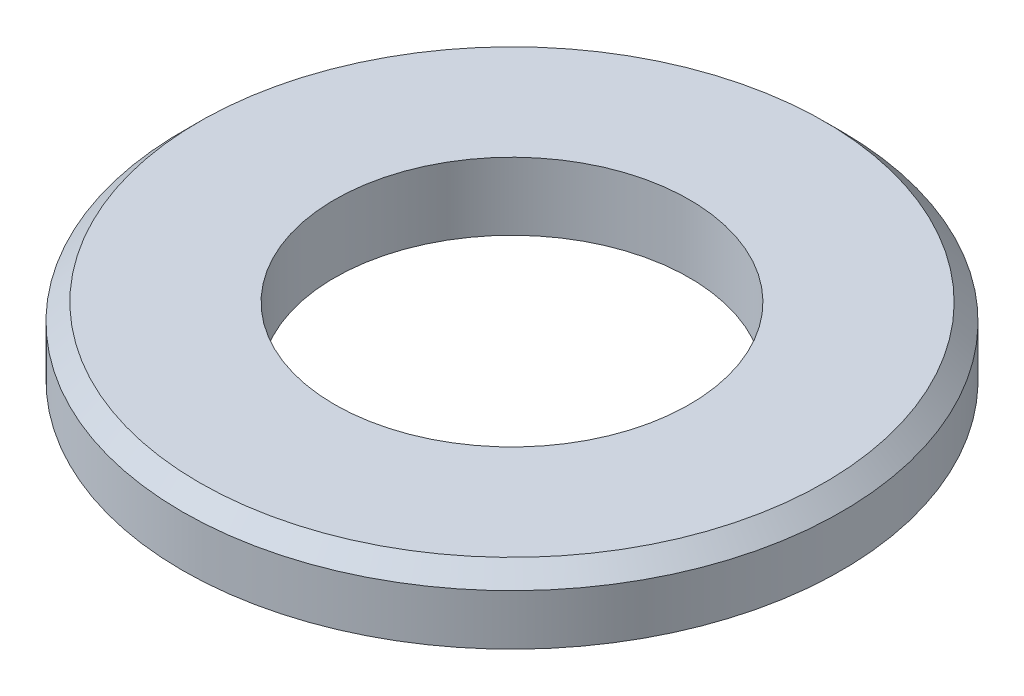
from build123d import *

# Parameters (mm, degrees)
SKIZZE1_R               = 19.5
SKIZZE1_R_2             = 10.5
LINEAR_AUSTRAGEN1_DEPTH = 4
FASE1_SIZE              = 1


with BuildPart() as part:
    # Skizze1 → Linear austragen1 (new body)
    with BuildSketch(Plane(origin=(0, 0, 0), x_dir=(1, 0, 0), z_dir=(0, 1, 0))):
        with Locations(Location((0, 0, 0), (0, 0, 270))):
            Circle(SKIZZE1_R)
        with Locations(Location((0, 0, 0), (0, 0, 270))):
            Circle(SKIZZE1_R_2, mode=Mode.SUBTRACT)
    extrude(amount=LINEAR_AUSTRAGEN1_DEPTH)

    # Fase1
    fase1_edges = [part.edges().sort_by_distance(p)[0] for p in [
        (0, 4, -19.5),
    ]]
    chamfer(fase1_edges, length=FASE1_SIZE)


solid = part.part
